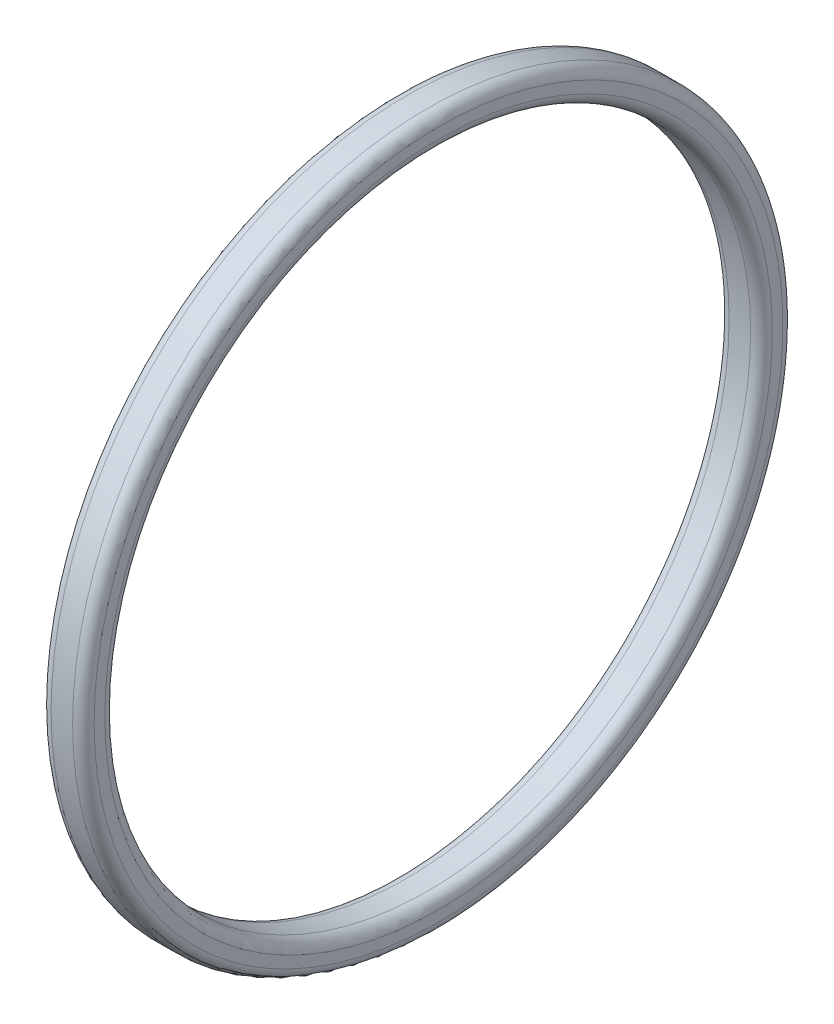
from build123d import *


with BuildPart() as part:
    # Esquisse1 → Base-R_volution (revolve)
    with BuildSketch(Plane.XY, mode=Mode.PRIVATE) as base_r_volution_sk:
        with BuildLine():
            Line((29.5, 16.5), (30.5, 16.5))
            ThreePointArc((30.5, 16.5), (30.853553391, 16.353553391), (31, 16))
            Line((31, 16), (31, 15.5))
            ThreePointArc((31, 15.5), (30.853553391, 15.146446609), (30.5, 15))
            Line((30.5, 15), (29.5, 15))
            ThreePointArc((29.5, 15), (29.146446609, 15.146446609), (29, 15.5))
            Line((29, 15.5), (29, 16))
            ThreePointArc((29, 16), (29.146446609, 16.353553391), (29.5, 16.5))
        make_face()
    revolve(base_r_volution_sk.sketch.rotate(Axis((0, 0, 0), (1, 0, 0)), 90), axis=Axis((0, 0, 0), (1, 0, 0)))


solid = part.part
